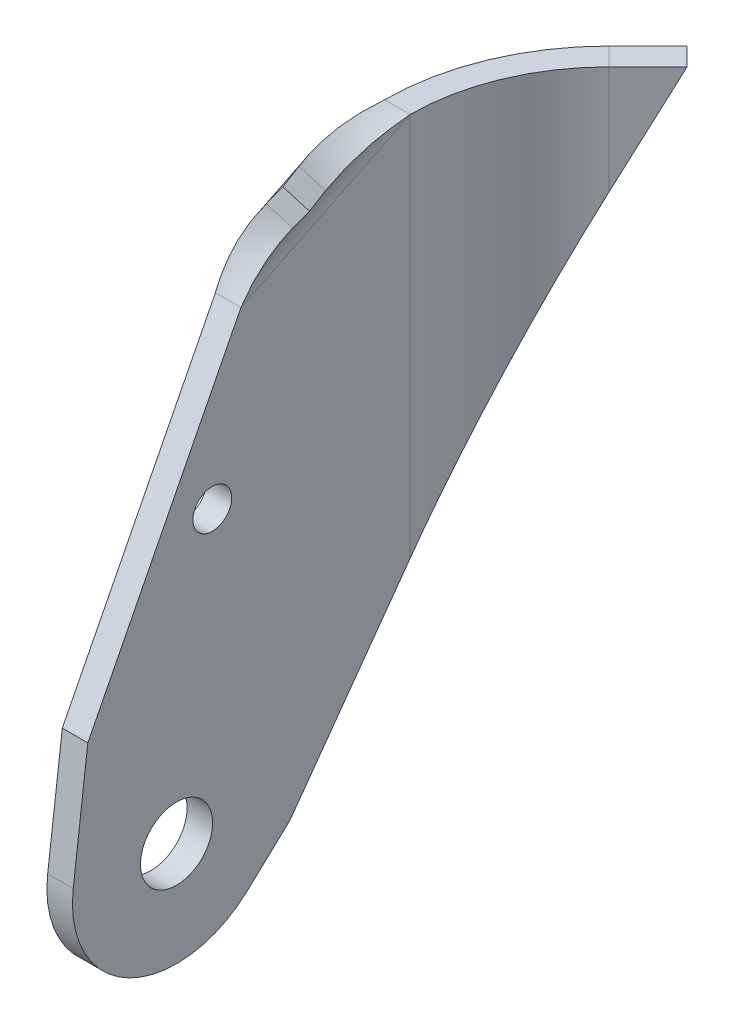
ISO-10303-21;
HEADER;
FILE_DESCRIPTION(('STEP AP214'),'2;1');
FILE_NAME('part.step','',(''),(''),'','','');
FILE_SCHEMA(('AUTOMOTIVE_DESIGN { 1 0 10303 214 1 1 1 1 }'));
ENDSEC;
DATA;
#1=APPLICATION_CONTEXT('core data for automotive mechanical design processes');
#2=APPLICATION_PROTOCOL_DEFINITION('international standard','automotive_design',2000,#1);
#3=PRODUCT_CONTEXT('',#1,'mechanical');
#4=PRODUCT('Part','Part','',(#3));
#5=PRODUCT_RELATED_PRODUCT_CATEGORY('part','',(#4));
#6=PRODUCT_DEFINITION_FORMATION('','',#4);
#7=PRODUCT_DEFINITION_CONTEXT('part definition',#1,'design');
#8=PRODUCT_DEFINITION('design','',#6,#7);
#9=PRODUCT_DEFINITION_SHAPE('','',#8);
#10=(LENGTH_UNIT() NAMED_UNIT(*) SI_UNIT(.MILLI.,.METRE.));
#11=(NAMED_UNIT(*) PLANE_ANGLE_UNIT() SI_UNIT($,.RADIAN.));
#12=(NAMED_UNIT(*) SI_UNIT($,.STERADIAN.) SOLID_ANGLE_UNIT());
#13=UNCERTAINTY_MEASURE_WITH_UNIT(LENGTH_MEASURE(1.E-05),#10,'distance_accuracy_value','');
#14=(GEOMETRIC_REPRESENTATION_CONTEXT(3) GLOBAL_UNCERTAINTY_ASSIGNED_CONTEXT((#13)) GLOBAL_UNIT_ASSIGNED_CONTEXT((#10,
#11,#12)) REPRESENTATION_CONTEXT('',''));
#15=CARTESIAN_POINT('',(0.,0.,0.));
#16=DIRECTION('',(0.,0.,1.));
#17=DIRECTION('',(1.,0.,0.));
#18=AXIS2_PLACEMENT_3D('',#15,#16,#17);
#19=CARTESIAN_POINT('',(4.6736,-113.2332,78.831893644));
#20=DIRECTION('',(1.,0.,0.));
#21=DIRECTION('',(0.,0.,-1.));
#22=AXIS2_PLACEMENT_3D('',#19,#20,#21);
#23=PLANE('',#22);
#24=CARTESIAN_POINT('',(4.6736,-94.1832,59.781893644));
#25=DIRECTION('',(1.,0.,0.));
#26=DIRECTION('',(0.,0.,-1.));
#27=AXIS2_PLACEMENT_3D('',#24,#25,#26);
#28=CIRCLE('',#27,6.604);
#29=CARTESIAN_POINT('',(4.6736,-94.1832,53.177893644));
#30=VERTEX_POINT('',#29);
#31=EDGE_CURVE('E866',#30,#30,#28,.T.);
#32=ORIENTED_EDGE('',*,*,#31,.F.);
#33=EDGE_LOOP('',(#32));
#34=FACE_BOUND('',#33,.T.);
#35=CARTESIAN_POINT('',(4.6736,-44.3992,53.23035582));
#36=DIRECTION('',(1.,0.,0.));
#37=DIRECTION('',(0.,0.,-1.));
#38=AXIS2_PLACEMENT_3D('',#35,#36,#37);
#39=CIRCLE('',#38,3.55600000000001);
#40=CARTESIAN_POINT('',(4.6736,-44.3992,49.67435582));
#41=VERTEX_POINT('',#40);
#42=EDGE_CURVE('E855',#41,#41,#39,.T.);
#43=ORIENTED_EDGE('',*,*,#42,.F.);
#44=EDGE_LOOP('',(#43));
#45=FACE_BOUND('',#44,.T.);
#46=DIRECTION('',(0.,-0.6819983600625,0.731353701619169));
#47=VECTOR('',#46,1.);
#48=CARTESIAN_POINT('',(4.6736,-126.477855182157,66.481052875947));
#49=LINE('',#48,#47);
#50=CARTESIAN_POINT('',(4.6736,-100.902050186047,39.054359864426));
#51=VERTEX_POINT('',#50);
#52=CARTESIAN_POINT('',(4.6736,-108.115488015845,46.7898248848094));
#53=VERTEX_POINT('',#52);
#54=EDGE_CURVE('E626',#51,#53,#49,.T.);
#55=ORIENTED_EDGE('',*,*,#54,.F.);
#56=DIRECTION('',(0.,-0.811311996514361,0.584613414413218));
#57=VECTOR('',#56,1.);
#58=CARTESIAN_POINT('',(4.6736,-127.885386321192,58.4979528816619));
#59=LINE('',#58,#57);
#60=CARTESIAN_POINT('',(4.6736,-70.3274998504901,17.0230176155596));
#61=VERTEX_POINT('',#60);
#62=EDGE_CURVE('E527',#61,#51,#59,.T.);
#63=ORIENTED_EDGE('',*,*,#62,.F.);
#64=DIRECTION('',(0.,1.,0.));
#65=VECTOR('',#64,1.);
#66=CARTESIAN_POINT('',(4.6736,-113.2332,17.0230176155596));
#67=LINE('',#66,#65);
#68=CARTESIAN_POINT('',(4.6736,0.,17.0230176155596));
#69=VERTEX_POINT('',#68);
#70=EDGE_CURVE('E514',#61,#69,#67,.T.);
#71=ORIENTED_EDGE('',*,*,#70,.T.);
#72=DIRECTION('',(0.,-0.438371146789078,0.898794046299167));
#73=VECTOR('',#72,1.);
#74=CARTESIAN_POINT('',(4.6736,-46.1129700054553,111.568617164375));
#75=LINE('',#74,#73);
#76=CARTESIAN_POINT('',(4.6736,-15.1074452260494,47.9978705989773));
#77=VERTEX_POINT('',#76);
#78=EDGE_CURVE('E520',#69,#77,#75,.T.);
#79=ORIENTED_EDGE('',*,*,#78,.T.);
#80=DIRECTION('',(0.,0.891006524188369,-0.453990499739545));
#81=VECTOR('',#80,1.);
#82=CARTESIAN_POINT('',(4.6736,-105.481382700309,94.0456917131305));
#83=LINE('',#82,#81);
#84=CARTESIAN_POINT('',(4.6736,-70.099829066,76.0178896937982));
#85=VERTEX_POINT('',#84);
#86=EDGE_CURVE('E854',#85,#77,#83,.T.);
#87=ORIENTED_EDGE('',*,*,#86,.F.);
#88=DIRECTION('',(0.,0.992546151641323,-0.121869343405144));
#89=VECTOR('',#88,1.);
#90=CARTESIAN_POINT('',(4.6736,-112.932961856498,81.2771370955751));
#91=LINE('',#90,#89);
#92=CARTESIAN_POINT('',(4.6736,-91.861589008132,78.6898978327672));
#93=VERTEX_POINT('',#92);
#94=EDGE_CURVE('E702',#93,#85,#91,.T.);
#95=ORIENTED_EDGE('',*,*,#94,.F.);
#96=CARTESIAN_POINT('',(4.6736,-94.1832,59.781893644));
#97=DIRECTION('',(1.,0.,0.));
#98=DIRECTION('',(0.,0.,-1.));
#99=AXIS2_PLACEMENT_3D('',#96,#97,#98);
#100=CIRCLE('',#99,19.05);
#101=EDGE_CURVE('E864',#93,#53,#100,.T.);
#102=ORIENTED_EDGE('',*,*,#101,.T.);
#103=EDGE_LOOP('',(#55,#63,#71,#79,#87,#95,#102));
#104=FACE_BOUND('',#103,.T.);
#105=ADVANCED_FACE('F511',(#34,#45,#104),#23,.T.);
#106=CARTESIAN_POINT('',(0.,-113.2332,78.831893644));
#107=DIRECTION('',(1.,0.,0.));
#108=DIRECTION('',(0.,0.,-1.));
#109=AXIS2_PLACEMENT_3D('',#106,#107,#108);
#110=PLANE('',#109);
#111=CARTESIAN_POINT('',(0.,-44.3992,53.23035582));
#112=DIRECTION('',(1.,0.,0.));
#113=DIRECTION('',(0.,0.,-1.));
#114=AXIS2_PLACEMENT_3D('',#111,#112,#113);
#115=CIRCLE('',#114,3.55600000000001);
#116=CARTESIAN_POINT('',(0.,-44.3992,49.67435582));
#117=VERTEX_POINT('',#116);
#118=EDGE_CURVE('E858',#117,#117,#115,.T.);
#119=ORIENTED_EDGE('',*,*,#118,.T.);
#120=EDGE_LOOP('',(#119));
#121=FACE_BOUND('',#120,.T.);
#122=CARTESIAN_POINT('',(0.,-94.1832,59.781893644));
#123=DIRECTION('',(1.,0.,0.));
#124=DIRECTION('',(0.,0.,-1.));
#125=AXIS2_PLACEMENT_3D('',#122,#123,#124);
#126=CIRCLE('',#125,6.604);
#127=CARTESIAN_POINT('',(0.,-94.1832,53.177893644));
#128=VERTEX_POINT('',#127);
#129=EDGE_CURVE('E869',#128,#128,#126,.T.);
#130=ORIENTED_EDGE('',*,*,#129,.T.);
#131=EDGE_LOOP('',(#130));
#132=FACE_BOUND('',#131,.T.);
#133=DIRECTION('',(0.,-0.811311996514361,0.584613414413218));
#134=VECTOR('',#133,1.);
#135=CARTESIAN_POINT('',(0.,-127.885386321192,58.4979528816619));
#136=LINE('',#135,#134);
#137=CARTESIAN_POINT('',(0.,-70.3274998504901,17.0230176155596));
#138=VERTEX_POINT('',#137);
#139=CARTESIAN_POINT('',(0.,-100.902050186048,39.054359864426));
#140=VERTEX_POINT('',#139);
#141=EDGE_CURVE('E621',#138,#140,#136,.T.);
#142=ORIENTED_EDGE('',*,*,#141,.T.);
#143=DIRECTION('',(0.,-0.6819983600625,0.731353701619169));
#144=VECTOR('',#143,1.);
#145=CARTESIAN_POINT('',(0.,-126.477855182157,66.481052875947));
#146=LINE('',#145,#144);
#147=CARTESIAN_POINT('',(0.,-108.115488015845,46.7898248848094));
#148=VERTEX_POINT('',#147);
#149=EDGE_CURVE('E842',#140,#148,#146,.T.);
#150=ORIENTED_EDGE('',*,*,#149,.T.);
#151=CARTESIAN_POINT('',(0.,-94.1832,59.781893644));
#152=DIRECTION('',(1.,0.,0.));
#153=DIRECTION('',(0.,0.,1.));
#154=AXIS2_PLACEMENT_3D('',#151,#152,#153);
#155=CIRCLE('',#154,19.05);
#156=CARTESIAN_POINT('',(0.,-91.861589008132,78.6898978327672));
#157=VERTEX_POINT('',#156);
#158=EDGE_CURVE('E861',#157,#148,#155,.T.);
#159=ORIENTED_EDGE('',*,*,#158,.F.);
#160=DIRECTION('',(0.,0.992546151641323,-0.121869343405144));
#161=VECTOR('',#160,1.);
#162=CARTESIAN_POINT('',(0.,-112.932961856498,81.2771370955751));
#163=LINE('',#162,#161);
#164=CARTESIAN_POINT('',(0.,-70.099829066,76.0178896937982));
#165=VERTEX_POINT('',#164);
#166=EDGE_CURVE('E848',#157,#165,#163,.T.);
#167=ORIENTED_EDGE('',*,*,#166,.T.);
#168=DIRECTION('',(0.,0.891006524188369,-0.453990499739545));
#169=VECTOR('',#168,1.);
#170=CARTESIAN_POINT('',(0.,-105.481382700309,94.0456917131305));
#171=LINE('',#170,#169);
#172=CARTESIAN_POINT('',(0.,-15.1074452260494,47.9978705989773));
#173=VERTEX_POINT('',#172);
#174=EDGE_CURVE('E695',#165,#173,#171,.T.);
#175=ORIENTED_EDGE('',*,*,#174,.T.);
#176=DIRECTION('',(0.,-0.438371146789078,0.898794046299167));
#177=VECTOR('',#176,1.);
#178=CARTESIAN_POINT('',(0.,-46.1129700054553,111.568617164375));
#179=LINE('',#178,#177);
#180=CARTESIAN_POINT('',(-5.22363055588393E-09,0.,17.0230176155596));
#181=VERTEX_POINT('',#180);
#182=EDGE_CURVE('E653',#181,#173,#179,.T.);
#183=ORIENTED_EDGE('',*,*,#182,.F.);
#184=DIRECTION('',(0.,1.,0.));
#185=VECTOR('',#184,1.);
#186=CARTESIAN_POINT('',(0.,-113.2332,17.0230176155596));
#187=LINE('',#186,#185);
#188=EDGE_CURVE('E633',#138,#181,#187,.T.);
#189=ORIENTED_EDGE('',*,*,#188,.F.);
#190=EDGE_LOOP('',(#142,#150,#159,#167,#175,#183,#189));
#191=FACE_BOUND('',#190,.T.);
#192=ADVANCED_FACE('F680',(#121,#132,#191),#110,.F.);
#193=CARTESIAN_POINT('',(3.30473425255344,-113.2332,3.30473425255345));
#194=DIRECTION('',(0.707106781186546,0.,0.707106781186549));
#195=DIRECTION('',(0.707106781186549,0.,-0.707106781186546));
#196=AXIS2_PLACEMENT_3D('',#193,#194,#195);
#197=PLANE('',#196);
#198=DIRECTION('',(0.,1.,0.));
#199=VECTOR('',#198,1.);
#200=CARTESIAN_POINT('',(15.3418254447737,-113.2332,-8.73235693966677));
#201=LINE('',#200,#199);
#202=CARTESIAN_POINT('',(15.3418254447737,-19.7797311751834,-8.73235693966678));
#203=VERTEX_POINT('',#202);
#204=CARTESIAN_POINT('',(15.3418254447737,0.,-8.73235693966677));
#205=VERTEX_POINT('',#204);
#206=EDGE_CURVE('E632',#203,#205,#201,.T.);
#207=ORIENTED_EDGE('',*,*,#206,.F.);
#208=DIRECTION('',(-0.321019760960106,-0.891006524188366,0.321019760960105));
#209=VECTOR('',#208,1.);
#210=CARTESIAN_POINT('',(-13.869669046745,-100.857706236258,20.4791375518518));
#211=LINE('',#210,#209);
#212=CARTESIAN_POINT('',(22.4682430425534,0.,-15.8587745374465));
#213=VERTEX_POINT('',#212);
#214=EDGE_CURVE('E935',#213,#203,#211,.T.);
#215=ORIENTED_EDGE('',*,*,#214,.F.);
#216=DIRECTION('',(0.707106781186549,0.,-0.707106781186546));
#217=VECTOR('',#216,1.);
#218=CARTESIAN_POINT('',(3.30473425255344,0.,3.30473425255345));
#219=LINE('',#218,#217);
#220=EDGE_CURVE('E872',#205,#213,#219,.T.);
#221=ORIENTED_EDGE('',*,*,#220,.F.);
#222=EDGE_LOOP('',(#207,#215,#221));
#223=FACE_BOUND('',#222,.T.);
#224=ADVANCED_FACE('F682',(#223),#197,.T.);
#225=CARTESIAN_POINT('',(41.0972,-113.2332,17.0230176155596));
#226=DIRECTION('',(0.,1.,0.));
#227=DIRECTION('',(0.,0.,1.));
#228=AXIS2_PLACEMENT_3D('',#225,#226,#227);
#229=CYLINDRICAL_SURFACE('',#228,36.4236);
#230=ORIENTED_EDGE('',*,*,#70,.F.);
#231=CARTESIAN_POINT('',(41.0972,-19.7797311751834,17.0230176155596));
#232=DIRECTION('',(-0.63003675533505,0.453990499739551,0.630036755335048));
#233=DIRECTION('',(0.321019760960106,0.891006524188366,-0.321019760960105));
#234=AXIS2_PLACEMENT_3D('',#231,#232,#233);
#235=ELLIPSE('',#234,80.2298726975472,36.4236);
#236=EDGE_CURVE('E609',#203,#61,#235,.T.);
#237=ORIENTED_EDGE('',*,*,#236,.F.);
#238=ORIENTED_EDGE('',*,*,#206,.T.);
#239=CARTESIAN_POINT('',(41.0972,0.,17.0230176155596));
#240=DIRECTION('',(0.,1.,0.));
#241=DIRECTION('',(1.,0.,0.));
#242=AXIS2_PLACEMENT_3D('',#239,#240,#241);
#243=CIRCLE('',#242,36.4236);
#244=EDGE_CURVE('E630',#69,#205,#243,.F.);
#245=ORIENTED_EDGE('',*,*,#244,.F.);
#246=EDGE_LOOP('',(#230,#237,#238,#245));
#247=FACE_BOUND('',#246,.T.);
#248=ADVANCED_FACE('F628',(#247),#229,.F.);
#249=CARTESIAN_POINT('',(41.0972,-113.2332,17.0230176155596));
#250=DIRECTION('',(0.,1.,0.));
#251=DIRECTION('',(0.,0.,1.));
#252=AXIS2_PLACEMENT_3D('',#249,#250,#251);
#253=CYLINDRICAL_SURFACE('',#252,41.0972);
#254=CARTESIAN_POINT('',(41.0972,-19.7797311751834,17.0230176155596));
#255=DIRECTION('',(-0.613020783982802,0.498408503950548,0.6130207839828));
#256=DIRECTION('',(0.352428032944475,0.866942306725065,-0.352428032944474));
#257=AXIS2_PLACEMENT_3D('',#254,#255,#256);
#258=ELLIPSE('',#257,82.456859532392,41.0972);
#259=CARTESIAN_POINT('',(12.0370911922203,-19.7797311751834,-12.0370911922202));
#260=VERTEX_POINT('',#259);
#261=EDGE_CURVE('E617',#260,#138,#258,.T.);
#262=ORIENTED_EDGE('',*,*,#261,.T.);
#263=ORIENTED_EDGE('',*,*,#188,.T.);
#264=CARTESIAN_POINT('',(41.0972,0.,17.0230176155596));
#265=DIRECTION('',(0.,1.,0.));
#266=DIRECTION('',(0.,0.,1.));
#267=AXIS2_PLACEMENT_3D('',#264,#265,#266);
#268=CIRCLE('',#267,41.0972);
#269=CARTESIAN_POINT('',(12.0370911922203,0.,-12.0370911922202));
#270=VERTEX_POINT('',#269);
#271=EDGE_CURVE('E879',#181,#270,#268,.F.);
#272=ORIENTED_EDGE('',*,*,#271,.T.);
#273=DIRECTION('',(0.,1.,0.));
#274=VECTOR('',#273,1.);
#275=CARTESIAN_POINT('',(12.0370911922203,-113.2332,-12.0370911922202));
#276=LINE('',#275,#274);
#277=EDGE_CURVE('E636',#260,#270,#276,.T.);
#278=ORIENTED_EDGE('',*,*,#277,.F.);
#279=EDGE_LOOP('',(#262,#263,#272,#278));
#280=FACE_BOUND('',#279,.T.);
#281=ADVANCED_FACE('F997',(#280),#253,.T.);
#282=CARTESIAN_POINT('',(0.,-113.2332,0.));
#283=DIRECTION('',(0.707106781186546,0.,0.707106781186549));
#284=DIRECTION('',(0.707106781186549,0.,-0.707106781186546));
#285=AXIS2_PLACEMENT_3D('',#282,#283,#284);
#286=PLANE('',#285);
#287=DIRECTION('',(-0.321019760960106,-0.891006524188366,0.321019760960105));
#288=VECTOR('',#287,1.);
#289=CARTESIAN_POINT('',(-17.1744032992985,-100.857706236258,17.1744032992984));
#290=LINE('',#289,#288);
#291=CARTESIAN_POINT('',(19.16350879,0.,-19.1635087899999));
#292=VERTEX_POINT('',#291);
#293=EDGE_CURVE('E937',#292,#260,#290,.T.);
#294=ORIENTED_EDGE('',*,*,#293,.T.);
#295=ORIENTED_EDGE('',*,*,#277,.T.);
#296=DIRECTION('',(0.707106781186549,0.,-0.707106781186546));
#297=VECTOR('',#296,1.);
#298=CARTESIAN_POINT('',(0.,0.,0.));
#299=LINE('',#298,#297);
#300=EDGE_CURVE('E877',#270,#292,#299,.T.);
#301=ORIENTED_EDGE('',*,*,#300,.T.);
#302=EDGE_LOOP('',(#294,#295,#301));
#303=FACE_BOUND('',#302,.T.);
#304=ADVANCED_FACE('F1000',(#303),#286,.F.);
#305=CARTESIAN_POINT('',(4.6736,-126.477855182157,66.481052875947));
#306=DIRECTION('',(0.,0.731353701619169,0.6819983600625));
#307=DIRECTION('',(0.,-0.6819983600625,0.731353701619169));
#308=AXIS2_PLACEMENT_3D('',#305,#306,#307);
#309=PLANE('',#308);
#310=ORIENTED_EDGE('',*,*,#149,.F.);
#311=DIRECTION('',(1.,0.,0.));
#312=VECTOR('',#311,1.);
#313=CARTESIAN_POINT('',(4.6736,-100.902050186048,39.054359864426));
#314=LINE('',#313,#312);
#315=EDGE_CURVE('E622',#51,#140,#314,.F.);
#316=ORIENTED_EDGE('',*,*,#315,.F.);
#317=ORIENTED_EDGE('',*,*,#54,.T.);
#318=DIRECTION('',(1.,0.,0.));
#319=VECTOR('',#318,1.);
#320=CARTESIAN_POINT('',(4.6736,-108.115488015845,46.7898248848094));
#321=LINE('',#320,#319);
#322=EDGE_CURVE('E834',#53,#148,#321,.F.);
#323=ORIENTED_EDGE('',*,*,#322,.T.);
#324=EDGE_LOOP('',(#310,#316,#317,#323));
#325=FACE_BOUND('',#324,.T.);
#326=ADVANCED_FACE('F686',(#325),#309,.F.);
#327=CARTESIAN_POINT('',(4.6736,-105.481382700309,94.0456917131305));
#328=DIRECTION('',(0.,-0.453990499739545,-0.891006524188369));
#329=DIRECTION('',(0.,0.891006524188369,-0.453990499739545));
#330=AXIS2_PLACEMENT_3D('',#327,#328,#329);
#331=PLANE('',#330);
#332=ORIENTED_EDGE('',*,*,#86,.T.);
#333=CARTESIAN_POINT('',(-5.22363055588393E-09,-15.1074452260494,47.9978705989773));
#334=CARTESIAN_POINT('',(4.67359999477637,-15.1074452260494,47.9978705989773));
#335=B_SPLINE_CURVE_WITH_KNOTS('',1,(#333,#334),.UNSPECIFIED.,.F.,.F.,(2,2),(0.,1.),.UNSPECIFIED.);
#336=EDGE_CURVE('E656',#77,#173,#335,.F.);
#337=ORIENTED_EDGE('',*,*,#336,.T.);
#338=ORIENTED_EDGE('',*,*,#174,.F.);
#339=DIRECTION('',(1.,0.,0.));
#340=VECTOR('',#339,1.);
#341=CARTESIAN_POINT('',(4.6736,-70.099829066,76.0178896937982));
#342=LINE('',#341,#340);
#343=EDGE_CURVE('E703',#85,#165,#342,.F.);
#344=ORIENTED_EDGE('',*,*,#343,.F.);
#345=EDGE_LOOP('',(#332,#337,#338,#344));
#346=FACE_BOUND('',#345,.T.);
#347=ADVANCED_FACE('F678',(#346),#331,.F.);
#348=CARTESIAN_POINT('',(12.0370911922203,0.,-12.0370911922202));
#349=DIRECTION('',(0.,1.,0.));
#350=DIRECTION('',(0.,0.,1.));
#351=AXIS2_PLACEMENT_3D('',#348,#349,#350);
#352=PLANE('',#351);
#353=DIRECTION('',(0.707106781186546,0.,0.707106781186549));
#354=VECTOR('',#353,1.);
#355=CARTESIAN_POINT('',(12.0370911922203,0.,-12.0370911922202));
#356=LINE('',#355,#354);
#357=EDGE_CURVE('E634',#270,#205,#356,.T.);
#358=ORIENTED_EDGE('',*,*,#357,.F.);
#359=ORIENTED_EDGE('',*,*,#271,.F.);
#360=CARTESIAN_POINT('',(4.67359999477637,0.,17.0230176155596));
#361=CARTESIAN_POINT('',(-5.22363055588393E-09,0.,17.0230176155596));
#362=B_SPLINE_CURVE_WITH_KNOTS('',1,(#360,#361),.UNSPECIFIED.,.F.,.F.,(2,2),(0.,1.),.UNSPECIFIED.);
#363=EDGE_CURVE('E12',#69,#181,#362,.T.);
#364=ORIENTED_EDGE('',*,*,#363,.F.);
#365=ORIENTED_EDGE('',*,*,#244,.T.);
#366=EDGE_LOOP('',(#358,#359,#364,#365));
#367=FACE_BOUND('',#366,.T.);
#368=ADVANCED_FACE('F667',(#367),#352,.T.);
#369=CARTESIAN_POINT('',(4.6736,0.,17.0230176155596));
#370=DIRECTION('',(0.,1.,0.));
#371=DIRECTION('',(0.,0.,1.));
#372=AXIS2_PLACEMENT_3D('',#369,#370,#371);
#373=PLANE('',#372);
#374=ORIENTED_EDGE('',*,*,#300,.F.);
#375=ORIENTED_EDGE('',*,*,#357,.T.);
#376=ORIENTED_EDGE('',*,*,#220,.T.);
#377=DIRECTION('',(0.707106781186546,0.,0.707106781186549));
#378=VECTOR('',#377,1.);
#379=CARTESIAN_POINT('',(19.16350879,0.,-19.1635087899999));
#380=LINE('',#379,#378);
#381=EDGE_CURVE('E875',#292,#213,#380,.T.);
#382=ORIENTED_EDGE('',*,*,#381,.F.);
#383=EDGE_LOOP('',(#374,#375,#376,#382));
#384=FACE_BOUND('',#383,.T.);
#385=ADVANCED_FACE('F677',(#384),#373,.T.);
#386=CARTESIAN_POINT('',(4.6736,-94.1832,59.781893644));
#387=DIRECTION('',(1.,0.,0.));
#388=DIRECTION('',(0.,0.,-1.));
#389=AXIS2_PLACEMENT_3D('',#386,#387,#388);
#390=CYLINDRICAL_SURFACE('',#389,6.604);
#391=ORIENTED_EDGE('',*,*,#129,.F.);
#392=EDGE_LOOP('',(#391));
#393=FACE_BOUND('',#392,.T.);
#394=ORIENTED_EDGE('',*,*,#31,.T.);
#395=EDGE_LOOP('',(#394));
#396=FACE_BOUND('',#395,.T.);
#397=ADVANCED_FACE('F987',(#393,#396),#390,.F.);
#398=CARTESIAN_POINT('',(0.,-94.1832,59.781893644));
#399=DIRECTION('',(1.,0.,0.));
#400=DIRECTION('',(0.,0.,-1.));
#401=AXIS2_PLACEMENT_3D('',#398,#399,#400);
#402=CYLINDRICAL_SURFACE('',#401,19.05);
#403=ORIENTED_EDGE('',*,*,#101,.F.);
#404=DIRECTION('',(1.,0.,0.));
#405=VECTOR('',#404,1.);
#406=CARTESIAN_POINT('',(4.6736,-91.861589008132,78.6898978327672));
#407=LINE('',#406,#405);
#408=EDGE_CURVE('E845',#93,#157,#407,.F.);
#409=ORIENTED_EDGE('',*,*,#408,.T.);
#410=ORIENTED_EDGE('',*,*,#158,.T.);
#411=ORIENTED_EDGE('',*,*,#322,.F.);
#412=EDGE_LOOP('',(#403,#409,#410,#411));
#413=FACE_BOUND('',#412,.T.);
#414=ADVANCED_FACE('F979',(#413),#402,.T.);
#415=CARTESIAN_POINT('',(4.6736,-44.3992,53.23035582));
#416=DIRECTION('',(1.,0.,0.));
#417=DIRECTION('',(0.,0.,-1.));
#418=AXIS2_PLACEMENT_3D('',#415,#416,#417);
#419=CYLINDRICAL_SURFACE('',#418,3.55600000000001);
#420=ORIENTED_EDGE('',*,*,#118,.F.);
#421=EDGE_LOOP('',(#420));
#422=FACE_BOUND('',#421,.T.);
#423=ORIENTED_EDGE('',*,*,#42,.T.);
#424=EDGE_LOOP('',(#423));
#425=FACE_BOUND('',#424,.T.);
#426=ADVANCED_FACE('F976',(#422,#425),#419,.F.);
#427=CARTESIAN_POINT('',(4.6736,-112.932961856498,81.2771370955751));
#428=DIRECTION('',(0.,-0.121869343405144,-0.992546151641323));
#429=DIRECTION('',(0.,0.992546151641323,-0.121869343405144));
#430=AXIS2_PLACEMENT_3D('',#427,#428,#429);
#431=PLANE('',#430);
#432=ORIENTED_EDGE('',*,*,#408,.F.);
#433=ORIENTED_EDGE('',*,*,#94,.T.);
#434=ORIENTED_EDGE('',*,*,#343,.T.);
#435=ORIENTED_EDGE('',*,*,#166,.F.);
#436=EDGE_LOOP('',(#432,#433,#434,#435));
#437=FACE_BOUND('',#436,.T.);
#438=ADVANCED_FACE('F978',(#437),#431,.F.);
#439=CARTESIAN_POINT('',(3.48388084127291,0.760510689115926,36.1672461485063));
#440=CARTESIAN_POINT('',(2.37502112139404,0.886474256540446,33.0996884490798));
#441=CARTESIAN_POINT('',(1.4947423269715,0.82810577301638,29.9424469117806));
#442=CARTESIAN_POINT('',(0.307034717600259,0.51275546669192,23.5308727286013));
#443=CARTESIAN_POINT('',(-5.22362938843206E-09,0.256609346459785,20.27716859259));
#444=CARTESIAN_POINT('',(-5.22363055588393E-09,0.,17.0230176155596));
#445=CARTESIAN_POINT('',(6.95704249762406,-2.05024191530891,34.7963505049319));
#446=CARTESIAN_POINT('',(6.2302745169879,-1.54289142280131,31.9148624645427));
#447=CARTESIAN_POINT('',(5.6533000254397,-1.15637002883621,28.9745533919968));
#448=CARTESIAN_POINT('',(4.8748399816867,-0.513492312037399,23.0303382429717));
#449=CARTESIAN_POINT('',(4.67359999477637,-0.256604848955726,20.02680247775));
#450=CARTESIAN_POINT('',(4.67359999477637,0.,17.0230176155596));
#451=B_SPLINE_SURFACE_WITH_KNOTS('',1,3,((#439,#440,#441,#442,#443,#444),(#445,#446,#447,#448,
#449,#450)),.UNSPECIFIED.,.F.,.F.,.F.,(2,2),(4,2,4),(0.,1.),(0.,0.5,1.),.UNSPECIFIED.);
#452=CARTESIAN_POINT('',(3.48388084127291,0.760510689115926,36.1672461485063));
#453=CARTESIAN_POINT('',(6.95704249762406,-2.05024191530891,34.7963505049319));
#454=B_SPLINE_CURVE_WITH_KNOTS('',1,(#452,#453),.UNSPECIFIED.,.F.,.F.,(2,2),(0.,1.),.UNSPECIFIED.);
#455=CARTESIAN_POINT('',(3.48388084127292,0.760510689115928,36.1672461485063));
#456=VERTEX_POINT('',#455);
#457=CARTESIAN_POINT('',(6.95704250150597,-2.05024191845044,34.7963505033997));
#458=VERTEX_POINT('',#457);
#459=EDGE_CURVE('E903',#456,#458,#454,.T.);
#460=CARTESIAN_POINT('',(6.95704249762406,-2.05024191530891,34.7963505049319));
#461=CARTESIAN_POINT('',(6.2302745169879,-1.54289142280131,31.9148624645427));
#462=CARTESIAN_POINT('',(5.6533000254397,-1.15637002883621,28.9745533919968));
#463=CARTESIAN_POINT('',(4.8748399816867,-0.513492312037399,23.0303382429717));
#464=CARTESIAN_POINT('',(4.67359999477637,-0.256604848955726,20.02680247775));
#465=CARTESIAN_POINT('',(4.67359999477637,0.,17.0230176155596));
#466=B_SPLINE_CURVE_WITH_KNOTS('',3,(#460,#461,#462,#463,#464,#465),.UNSPECIFIED.,.F.,.F.,(4,2,
4),(0.,0.5,1.),.UNSPECIFIED.);
#467=EDGE_CURVE('E896',#458,#69,#466,.T.);
#468=CARTESIAN_POINT('',(-5.22363055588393E-09,0.,17.0230176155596));
#469=CARTESIAN_POINT('',(-5.22362938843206E-09,0.256609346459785,20.27716859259));
#470=CARTESIAN_POINT('',(0.307034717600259,0.51275546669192,23.5308727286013));
#471=CARTESIAN_POINT('',(1.4947423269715,0.82810577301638,29.9424469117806));
#472=CARTESIAN_POINT('',(2.37502112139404,0.886474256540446,33.0996884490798));
#473=CARTESIAN_POINT('',(3.48388084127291,0.760510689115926,36.1672461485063));
#474=B_SPLINE_CURVE_WITH_KNOTS('',3,(#468,#469,#470,#471,#472,#473),.UNSPECIFIED.,.F.,.F.,(4,2,
4),(0.,0.5,1.),.UNSPECIFIED.);
#475=EDGE_CURVE('E929',#456,#181,#474,.F.);
#476=ORIENTED_EDGE('',*,*,#459,.T.);
#477=ORIENTED_EDGE('',*,*,#467,.T.);
#478=ORIENTED_EDGE('',*,*,#363,.T.);
#479=ORIENTED_EDGE('',*,*,#475,.F.);
#480=EDGE_LOOP('',(#476,#477,#478,#479));
#481=FACE_BOUND('',#480,.T.);
#482=ADVANCED_FACE('F803',(#481),#451,.T.);
#483=CARTESIAN_POINT('',(-5.22363055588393E-09,-15.1074452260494,47.9978705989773));
#484=CARTESIAN_POINT('',(-5.2236338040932E-09,-12.8199866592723,47.0882648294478));
#485=CARTESIAN_POINT('',(0.307034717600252,-10.533257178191,46.1785548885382));
#486=CARTESIAN_POINT('',(1.4947423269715,-6.1564742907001,44.2629582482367));
#487=CARTESIAN_POINT('',(2.37499143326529,-4.06751220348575,43.2567907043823));
#488=CARTESIAN_POINT('',(3.48388084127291,-2.16263679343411,42.1605866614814));
#489=CARTESIAN_POINT('',(4.67359999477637,-15.1074452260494,47.9978705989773));
#490=CARTESIAN_POINT('',(4.67359999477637,-13.3332654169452,46.8379749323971));
#491=CARTESIAN_POINT('',(4.8748399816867,-11.5595049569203,45.6780204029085));
#492=CARTESIAN_POINT('',(5.65330002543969,-8.14095009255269,43.2950647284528));
#493=CARTESIAN_POINT('',(6.23026130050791,-6.49681900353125,42.0718857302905));
#494=CARTESIAN_POINT('',(6.95704249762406,-4.97338939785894,40.7896910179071));
#495=B_SPLINE_SURFACE_WITH_KNOTS('',1,3,((#483,#484,#485,#486,#487,#488),(#489,#490,#491,#492,
#493,#494)),.UNSPECIFIED.,.F.,.F.,.F.,(2,2),(4,2,4),(0.,1.),(0.,0.5,1.),.UNSPECIFIED.);
#496=CARTESIAN_POINT('',(4.67359999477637,-15.1074452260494,47.9978705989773));
#497=CARTESIAN_POINT('',(4.67359999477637,-13.3332654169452,46.8379749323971));
#498=CARTESIAN_POINT('',(4.8748399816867,-11.5595049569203,45.6780204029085));
#499=CARTESIAN_POINT('',(5.65330002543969,-8.14095009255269,43.2950647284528));
#500=CARTESIAN_POINT('',(6.23026130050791,-6.49681900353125,42.0718857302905));
#501=CARTESIAN_POINT('',(6.95704249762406,-4.97338939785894,40.7896910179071));
#502=B_SPLINE_CURVE_WITH_KNOTS('',3,(#496,#497,#498,#499,#500,#501),.UNSPECIFIED.,.F.,.F.,(4,2,
4),(0.,0.5,1.),.UNSPECIFIED.);
#503=CARTESIAN_POINT('',(6.95704250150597,-4.97338940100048,40.7896910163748));
#504=VERTEX_POINT('',#503);
#505=EDGE_CURVE('E897',#77,#504,#502,.T.);
#506=CARTESIAN_POINT('',(6.95704249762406,-4.97338939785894,40.7896910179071));
#507=CARTESIAN_POINT('',(3.48388084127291,-2.16263679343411,42.1605866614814));
#508=B_SPLINE_CURVE_WITH_KNOTS('',1,(#506,#507),.UNSPECIFIED.,.F.,.F.,(2,2),(0.,1.),.UNSPECIFIED.);
#509=CARTESIAN_POINT('',(3.48388084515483,-2.16263679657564,42.1605866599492));
#510=VERTEX_POINT('',#509);
#511=EDGE_CURVE('E710',#504,#510,#508,.T.);
#512=CARTESIAN_POINT('',(3.48388084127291,-2.16263679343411,42.1605866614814));
#513=CARTESIAN_POINT('',(2.37499143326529,-4.06751220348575,43.2567907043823));
#514=CARTESIAN_POINT('',(1.4947423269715,-6.1564742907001,44.2629582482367));
#515=CARTESIAN_POINT('',(0.307034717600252,-10.533257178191,46.1785548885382));
#516=CARTESIAN_POINT('',(-5.2236338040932E-09,-12.8199866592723,47.0882648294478));
#517=CARTESIAN_POINT('',(-5.22363055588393E-09,-15.1074452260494,47.9978705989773));
#518=B_SPLINE_CURVE_WITH_KNOTS('',3,(#512,#513,#514,#515,#516,#517),.UNSPECIFIED.,.F.,.F.,(4,2,
4),(0.,0.5,1.),.UNSPECIFIED.);
#519=EDGE_CURVE('E786',#173,#510,#518,.F.);
#520=ORIENTED_EDGE('',*,*,#505,.T.);
#521=ORIENTED_EDGE('',*,*,#511,.T.);
#522=ORIENTED_EDGE('',*,*,#519,.F.);
#523=ORIENTED_EDGE('',*,*,#336,.F.);
#524=EDGE_LOOP('',(#520,#521,#522,#523));
#525=FACE_BOUND('',#524,.T.);
#526=ADVANCED_FACE('F760',(#525),#495,.T.);
#527=CARTESIAN_POINT('',(13.5636,-22.7994553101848,63.7688284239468));
#528=DIRECTION('',(0.,0.438371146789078,-0.898794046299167));
#529=DIRECTION('',(0.,0.898794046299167,0.438371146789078));
#530=AXIS2_PLACEMENT_3D('',#527,#528,#529);
#531=CYLINDRICAL_SURFACE('',#530,13.5636000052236);
#532=ORIENTED_EDGE('',*,*,#182,.T.);
#533=ORIENTED_EDGE('',*,*,#519,.T.);
#534=DIRECTION('',(0.,-0.438371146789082,0.898794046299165));
#535=VECTOR('',#534,1.);
#536=CARTESIAN_POINT('',(3.48388084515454,-37.955677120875,115.547194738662));
#537=LINE('',#536,#535);
#538=EDGE_CURVE('E709',#456,#510,#537,.T.);
#539=ORIENTED_EDGE('',*,*,#538,.F.);
#540=ORIENTED_EDGE('',*,*,#475,.T.);
#541=EDGE_LOOP('',(#532,#533,#539,#540));
#542=FACE_BOUND('',#541,.T.);
#543=ADVANCED_FACE('F758',(#542),#531,.T.);
#544=CARTESIAN_POINT('',(13.5636,-22.7994553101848,63.7688284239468));
#545=DIRECTION('',(0.,0.438371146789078,-0.898794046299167));
#546=DIRECTION('',(0.,0.898794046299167,0.438371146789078));
#547=AXIS2_PLACEMENT_3D('',#544,#545,#546);
#548=CYLINDRICAL_SURFACE('',#547,8.89000000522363);
#549=ORIENTED_EDGE('',*,*,#78,.F.);
#550=ORIENTED_EDGE('',*,*,#467,.F.);
#551=DIRECTION('',(0.,-0.438371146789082,0.898794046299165));
#552=VECTOR('',#551,1.);
#553=CARTESIAN_POINT('',(6.95704250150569,-40.7664297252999,114.176299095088));
#554=LINE('',#553,#552);
#555=EDGE_CURVE('E731',#458,#504,#554,.T.);
#556=ORIENTED_EDGE('',*,*,#555,.T.);
#557=ORIENTED_EDGE('',*,*,#505,.F.);
#558=EDGE_LOOP('',(#549,#550,#556,#557));
#559=FACE_BOUND('',#558,.T.);
#560=ADVANCED_FACE('F754',(#559),#548,.F.);
#561=CARTESIAN_POINT('',(-51.9922471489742,-93.3326091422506,88.5380603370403));
#562=DIRECTION('',(0.743144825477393,-0.601410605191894,-0.293327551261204));
#563=DIRECTION('',(-0.293327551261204,0.101202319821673,-0.950640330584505));
#564=AXIS2_PLACEMENT_3D('',#561,#562,#563);
#565=PLANE('',#564);
#566=DIRECTION('',(-0.293327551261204,0.101202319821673,-0.950640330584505));
#567=VECTOR('',#566,1.);
#568=CARTESIAN_POINT('',(16.1074001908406,-3.59478917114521,77.0785978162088));
#569=LINE('',#568,#567);
#570=CARTESIAN_POINT('',(4.80500539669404,0.304703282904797,40.4488565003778));
#571=VERTEX_POINT('',#570);
#572=EDGE_CURVE('E706',#571,#456,#569,.T.);
#573=ORIENTED_EDGE('',*,*,#572,.T.);
#574=ORIENTED_EDGE('',*,*,#538,.T.);
#575=DIRECTION('',(0.402692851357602,0.752071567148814,-0.521753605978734));
#576=VECTOR('',#575,1.);
#577=CARTESIAN_POINT('',(-42.8675958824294,-88.7289307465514,102.216408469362));
#578=LINE('',#577,#576);
#579=EDGE_CURVE('E714',#510,#571,#578,.T.);
#580=ORIENTED_EDGE('',*,*,#579,.T.);
#581=EDGE_LOOP('',(#573,#574,#580));
#582=FACE_BOUND('',#581,.T.);
#583=ADVANCED_FACE('F744',(#582),#565,.F.);
#584=CARTESIAN_POINT('',(-39.3944342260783,-91.5396833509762,100.845512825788));
#585=DIRECTION('',(-0.534391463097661,-0.269617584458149,-0.801081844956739));
#586=DIRECTION('',(0.402692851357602,0.752071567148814,-0.521753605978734));
#587=AXIS2_PLACEMENT_3D('',#584,#585,#586);
#588=PLANE('',#587);
#589=ORIENTED_EDGE('',*,*,#511,.F.);
#590=DIRECTION('',(0.402692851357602,0.752071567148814,-0.521753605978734));
#591=VECTOR('',#590,1.);
#592=CARTESIAN_POINT('',(-39.3944342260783,-91.5396833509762,100.845512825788));
#593=LINE('',#592,#591);
#594=CARTESIAN_POINT('',(8.27816705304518,-2.50604932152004,39.0779608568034));
#595=VERTEX_POINT('',#594);
#596=EDGE_CURVE('E718',#504,#595,#593,.T.);
#597=ORIENTED_EDGE('',*,*,#596,.T.);
#598=DIRECTION('',(0.743144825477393,-0.601410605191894,-0.293327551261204));
#599=VECTOR('',#598,1.);
#600=CARTESIAN_POINT('',(8.27816705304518,-2.50604932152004,39.0779608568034));
#601=LINE('',#600,#599);
#602=EDGE_CURVE('E941',#595,#571,#601,.F.);
#603=ORIENTED_EDGE('',*,*,#602,.T.);
#604=ORIENTED_EDGE('',*,*,#579,.F.);
#605=EDGE_LOOP('',(#589,#597,#603,#604));
#606=FACE_BOUND('',#605,.T.);
#607=ADVANCED_FACE('F733',(#606),#588,.F.);
#608=CARTESIAN_POINT('',(-48.519085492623,-96.1433617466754,87.1671646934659));
#609=DIRECTION('',(0.743144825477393,-0.601410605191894,-0.293327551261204));
#610=DIRECTION('',(-0.293327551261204,0.101202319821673,-0.950640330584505));
#611=AXIS2_PLACEMENT_3D('',#608,#609,#610);
#612=PLANE('',#611);
#613=ORIENTED_EDGE('',*,*,#555,.F.);
#614=DIRECTION('',(-0.293327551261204,0.101202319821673,-0.950640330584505));
#615=VECTOR('',#614,1.);
#616=CARTESIAN_POINT('',(19.5805618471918,-6.40554177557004,75.7077021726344));
#617=LINE('',#616,#615);
#618=EDGE_CURVE('E905',#595,#458,#617,.T.);
#619=ORIENTED_EDGE('',*,*,#618,.F.);
#620=ORIENTED_EDGE('',*,*,#596,.F.);
#621=EDGE_LOOP('',(#613,#619,#620));
#622=FACE_BOUND('',#621,.T.);
#623=ADVANCED_FACE('F743',(#622),#612,.T.);
#624=CARTESIAN_POINT('',(28.5183254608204,-22.0558794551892,6.26564643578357));
#625=DIRECTION('',(0.601410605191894,0.792504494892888,-0.101202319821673));
#626=DIRECTION('',(0.293327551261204,-0.101202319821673,0.950640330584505));
#627=AXIS2_PLACEMENT_3D('',#624,#625,#626);
#628=PLANE('',#627);
#629=ORIENTED_EDGE('',*,*,#459,.F.);
#630=ORIENTED_EDGE('',*,*,#572,.F.);
#631=ORIENTED_EDGE('',*,*,#602,.F.);
#632=ORIENTED_EDGE('',*,*,#618,.T.);
#633=EDGE_LOOP('',(#629,#630,#631,#632));
#634=FACE_BOUND('',#633,.T.);
#635=ADVANCED_FACE('F747',(#634),#628,.T.);
#636=CARTESIAN_POINT('',(-17.1744032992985,-100.857706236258,17.1744032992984));
#637=DIRECTION('',(-0.63003675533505,0.453990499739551,0.630036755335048));
#638=DIRECTION('',(-0.321019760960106,-0.891006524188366,0.321019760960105));
#639=AXIS2_PLACEMENT_3D('',#636,#637,#638);
#640=PLANE('',#639);
#641=DIRECTION('',(-0.707106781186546,0.,-0.707106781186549));
#642=VECTOR('',#641,1.);
#643=CARTESIAN_POINT('',(12.0370911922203,-19.7797311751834,-12.0370911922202));
#644=LINE('',#643,#642);
#645=EDGE_CURVE('E614',#260,#203,#644,.F.);
#646=ORIENTED_EDGE('',*,*,#645,.F.);
#647=ORIENTED_EDGE('',*,*,#293,.F.);
#648=ORIENTED_EDGE('',*,*,#381,.T.);
#649=ORIENTED_EDGE('',*,*,#214,.T.);
#650=EDGE_LOOP('',(#646,#647,#648,#649));
#651=FACE_BOUND('',#650,.T.);
#652=ADVANCED_FACE('F752',(#651),#640,.F.);
#653=CARTESIAN_POINT('',(4.6736,-127.885386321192,58.4979528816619));
#654=DIRECTION('',(0.,0.584613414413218,0.811311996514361));
#655=DIRECTION('',(0.,-0.811311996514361,0.584613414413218));
#656=AXIS2_PLACEMENT_3D('',#653,#654,#655);
#657=PLANE('',#656);
#658=ORIENTED_EDGE('',*,*,#62,.T.);
#659=ORIENTED_EDGE('',*,*,#315,.T.);
#660=ORIENTED_EDGE('',*,*,#141,.F.);
#661=DIRECTION('',(1.,0.,0.));
#662=VECTOR('',#661,1.);
#663=CARTESIAN_POINT('',(4.6736,-70.3274998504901,17.0230176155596));
#664=LINE('',#663,#662);
#665=EDGE_CURVE('E612',#61,#138,#664,.F.);
#666=ORIENTED_EDGE('',*,*,#665,.F.);
#667=EDGE_LOOP('',(#658,#659,#660,#666));
#668=FACE_BOUND('',#667,.T.);
#669=ADVANCED_FACE('F619',(#668),#657,.F.);
#670=CARTESIAN_POINT('',(66.8525745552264,51.7056088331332,-8.73235693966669));
#671=CARTESIAN_POINT('',(67.9541526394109,51.7056088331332,-9.83393502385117));
#672=CARTESIAN_POINT('',(69.0557307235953,51.7056088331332,-10.9355131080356));
#673=CARTESIAN_POINT('',(70.1573088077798,51.7056088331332,-12.0370911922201));
#674=CARTESIAN_POINT('',(15.3418254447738,51.7056088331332,-60.2431060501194));
#675=CARTESIAN_POINT('',(14.2402473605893,51.7056088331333,-63.5478403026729));
#676=CARTESIAN_POINT('',(13.1386692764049,51.7056088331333,-66.8525745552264));
#677=CARTESIAN_POINT('',(12.0370911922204,51.7056088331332,-70.1573088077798));
#678=CARTESIAN_POINT('',(-36.1689236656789,-91.2650711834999,-8.73235693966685));
#679=CARTESIAN_POINT('',(-39.4736579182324,-91.2650711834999,-9.83393502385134));
#680=CARTESIAN_POINT('',(-42.7783921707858,-91.2650711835,-10.9355131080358));
#681=CARTESIAN_POINT('',(-46.0831264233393,-91.2650711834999,-12.0370911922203));
#682=CARTESIAN_POINT('',(15.3418254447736,-91.2650711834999,42.7783921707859));
#683=CARTESIAN_POINT('',(14.2402473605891,-91.2650711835,43.8799702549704));
#684=CARTESIAN_POINT('',(13.1386692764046,-91.2650711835,44.9815483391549));
#685=CARTESIAN_POINT('',(12.0370911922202,-91.2650711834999,46.0831264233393));
#686=CARTESIAN_POINT('',(66.8525745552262,-91.2650711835,94.2891412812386));
#687=CARTESIAN_POINT('',(67.9541526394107,-91.2650711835,97.5938755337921));
#688=CARTESIAN_POINT('',(69.0557307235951,-91.2650711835,100.898609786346));
#689=CARTESIAN_POINT('',(70.1573088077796,-91.2650711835,104.203344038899));
#690=CARTESIAN_POINT('',(118.363323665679,51.7056088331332,42.778392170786));
#691=CARTESIAN_POINT('',(121.668057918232,51.7056088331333,43.8799702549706));
#692=CARTESIAN_POINT('',(124.972792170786,51.7056088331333,44.981548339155));
#693=CARTESIAN_POINT('',(128.277526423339,51.7056088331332,46.0831264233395));
#694=CARTESIAN_POINT('',(66.8525745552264,51.7056088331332,-8.73235693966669));
#695=CARTESIAN_POINT('',(67.9541526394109,51.7056088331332,-9.83393502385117));
#696=CARTESIAN_POINT('',(69.0557307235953,51.7056088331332,-10.9355131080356));
#697=CARTESIAN_POINT('',(70.1573088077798,51.7056088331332,-12.0370911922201));
#698=(BOUNDED_SURFACE() B_SPLINE_SURFACE(3,3,((#670,#671,#672,#673),(#674,#675,#676,#677),(#678,
#679,#680,#681),(#682,#683,#684,#685),(#686,#687,#688,#689),(#690,#691,#692,#693),(#694,#695,
#696,#697)),.UNSPECIFIED.,.T.,.F.,.F.) B_SPLINE_SURFACE_WITH_KNOTS((4,3,4),(4,4),(0.,0.5,1.),
(0.,1.),.UNSPECIFIED.) GEOMETRIC_REPRESENTATION_ITEM() RATIONAL_B_SPLINE_SURFACE(((1.,1.,1.,1.),
(0.333333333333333,0.333333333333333,0.333333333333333,0.333333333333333),(0.333333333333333,
0.333333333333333,0.333333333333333,0.333333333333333),(1.,1.,1.,1.),(0.333333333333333,
0.333333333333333,0.333333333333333,0.333333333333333),(0.333333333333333,0.333333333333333,
0.333333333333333,0.333333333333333),(1.,1.,1.,1.))) REPRESENTATION_ITEM('') SURFACE());
#699=ORIENTED_EDGE('',*,*,#236,.T.);
#700=ORIENTED_EDGE('',*,*,#665,.T.);
#701=ORIENTED_EDGE('',*,*,#261,.F.);
#702=ORIENTED_EDGE('',*,*,#645,.T.);
#703=EDGE_LOOP('',(#699,#700,#701,#702));
#704=FACE_BOUND('',#703,.T.);
#705=ADVANCED_FACE('F610',(#704),#698,.T.);
#706=CLOSED_SHELL('',(#105,#192,#224,#248,#281,#304,#326,#347,#368,#385,#397,#414,#426,#438,
#482,#526,#543,#560,#583,#607,#623,#635,#652,#669,#705));
#707=MANIFOLD_SOLID_BREP('B2',#706);
#708=ADVANCED_BREP_SHAPE_REPRESENTATION('',(#18,#707),#14);
#709=SHAPE_DEFINITION_REPRESENTATION(#9,#708);
ENDSEC;
END-ISO-10303-21;
